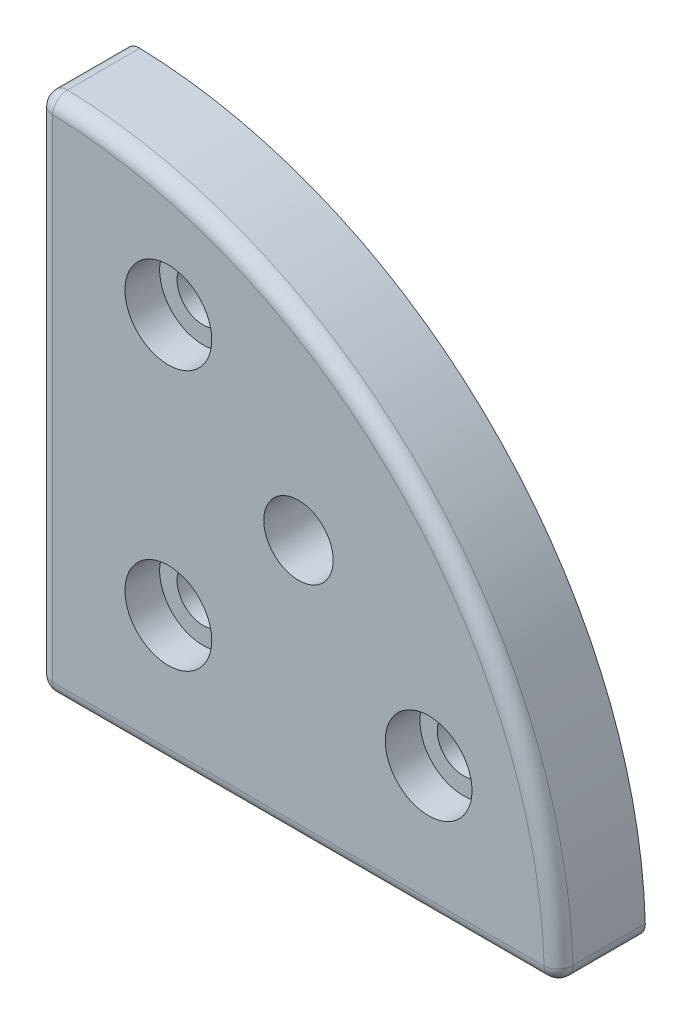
ISO-10303-21;
HEADER;
FILE_DESCRIPTION(('STEP AP214'),'2;1');
FILE_NAME('part.step','',(''),(''),'','','');
FILE_SCHEMA(('AUTOMOTIVE_DESIGN { 1 0 10303 214 1 1 1 1 }'));
ENDSEC;
DATA;
#1=APPLICATION_CONTEXT('core data for automotive mechanical design processes');
#2=APPLICATION_PROTOCOL_DEFINITION('international standard','automotive_design',2000,#1);
#3=PRODUCT_CONTEXT('',#1,'mechanical');
#4=PRODUCT('Part','Part','',(#3));
#5=PRODUCT_RELATED_PRODUCT_CATEGORY('part','',(#4));
#6=PRODUCT_DEFINITION_FORMATION('','',#4);
#7=PRODUCT_DEFINITION_CONTEXT('part definition',#1,'design');
#8=PRODUCT_DEFINITION('design','',#6,#7);
#9=PRODUCT_DEFINITION_SHAPE('','',#8);
#10=(LENGTH_UNIT() NAMED_UNIT(*) SI_UNIT(.MILLI.,.METRE.));
#11=(NAMED_UNIT(*) PLANE_ANGLE_UNIT() SI_UNIT($,.RADIAN.));
#12=(NAMED_UNIT(*) SI_UNIT($,.STERADIAN.) SOLID_ANGLE_UNIT());
#13=UNCERTAINTY_MEASURE_WITH_UNIT(LENGTH_MEASURE(1.E-05),#10,'distance_accuracy_value','');
#14=(GEOMETRIC_REPRESENTATION_CONTEXT(3) GLOBAL_UNCERTAINTY_ASSIGNED_CONTEXT((#13)) GLOBAL_UNIT_ASSIGNED_CONTEXT((#10,
#11,#12)) REPRESENTATION_CONTEXT('',''));
#15=CARTESIAN_POINT('',(0.,0.,0.));
#16=DIRECTION('',(0.,0.,1.));
#17=DIRECTION('',(1.,0.,0.));
#18=AXIS2_PLACEMENT_3D('',#15,#16,#17);
#19=CARTESIAN_POINT('',(65.9103992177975,51.8447142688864,9.));
#20=DIRECTION('',(0.,0.,1.));
#21=DIRECTION('',(1.,0.,0.));
#22=AXIS2_PLACEMENT_3D('',#19,#20,#21);
#23=CYLINDRICAL_SURFACE('',#22,7.5);
#24=CARTESIAN_POINT('',(65.9103992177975,51.8447142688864,9.));
#25=DIRECTION('',(0.,0.,1.));
#26=DIRECTION('',(1.,0.,0.));
#27=AXIS2_PLACEMENT_3D('',#24,#25,#26);
#28=CIRCLE('',#27,7.5);
#29=CARTESIAN_POINT('',(73.4103992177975,51.8447142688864,9.));
#30=VERTEX_POINT('',#29);
#31=EDGE_CURVE('E150',#30,#30,#28,.T.);
#32=ORIENTED_EDGE('',*,*,#31,.F.);
#33=EDGE_LOOP('',(#32));
#34=FACE_BOUND('',#33,.T.);
#35=CARTESIAN_POINT('',(65.9103992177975,51.8447142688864,15.));
#36=DIRECTION('',(0.,0.,1.));
#37=DIRECTION('',(1.,0.,0.));
#38=AXIS2_PLACEMENT_3D('',#35,#36,#37);
#39=CIRCLE('',#38,7.5);
#40=CARTESIAN_POINT('',(73.4103992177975,51.8447142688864,15.));
#41=VERTEX_POINT('',#40);
#42=EDGE_CURVE('E159',#41,#41,#39,.F.);
#43=ORIENTED_EDGE('',*,*,#42,.F.);
#44=EDGE_LOOP('',(#43));
#45=FACE_BOUND('',#44,.T.);
#46=ADVANCED_FACE('F15',(#34,#45),#23,.F.);
#47=CARTESIAN_POINT('',(20.9103992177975,51.8447142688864,9.));
#48=DIRECTION('',(0.,0.,1.));
#49=DIRECTION('',(1.,0.,0.));
#50=AXIS2_PLACEMENT_3D('',#47,#48,#49);
#51=CYLINDRICAL_SURFACE('',#50,7.5);
#52=CARTESIAN_POINT('',(20.9103992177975,51.8447142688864,9.));
#53=DIRECTION('',(0.,0.,1.));
#54=DIRECTION('',(1.,0.,0.));
#55=AXIS2_PLACEMENT_3D('',#52,#53,#54);
#56=CIRCLE('',#55,7.5);
#57=CARTESIAN_POINT('',(28.4103992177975,51.8447142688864,9.));
#58=VERTEX_POINT('',#57);
#59=EDGE_CURVE('E147',#58,#58,#56,.T.);
#60=ORIENTED_EDGE('',*,*,#59,.F.);
#61=EDGE_LOOP('',(#60));
#62=FACE_BOUND('',#61,.T.);
#63=CARTESIAN_POINT('',(20.9103992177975,51.8447142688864,15.));
#64=DIRECTION('',(0.,0.,1.));
#65=DIRECTION('',(1.,0.,0.));
#66=AXIS2_PLACEMENT_3D('',#63,#64,#65);
#67=CIRCLE('',#66,7.5);
#68=CARTESIAN_POINT('',(28.4103992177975,51.8447142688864,15.));
#69=VERTEX_POINT('',#68);
#70=EDGE_CURVE('E156',#69,#69,#67,.F.);
#71=ORIENTED_EDGE('',*,*,#70,.F.);
#72=EDGE_LOOP('',(#71));
#73=FACE_BOUND('',#72,.T.);
#74=ADVANCED_FACE('F432',(#62,#73),#51,.F.);
#75=CARTESIAN_POINT('',(20.9103992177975,96.8447142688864,9.));
#76=DIRECTION('',(0.,0.,1.));
#77=DIRECTION('',(1.,0.,0.));
#78=AXIS2_PLACEMENT_3D('',#75,#76,#77);
#79=CYLINDRICAL_SURFACE('',#78,7.5);
#80=CARTESIAN_POINT('',(20.9103992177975,96.8447142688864,9.));
#81=DIRECTION('',(0.,0.,1.));
#82=DIRECTION('',(1.,0.,0.));
#83=AXIS2_PLACEMENT_3D('',#80,#81,#82);
#84=CIRCLE('',#83,7.5);
#85=CARTESIAN_POINT('',(28.4103992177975,96.8447142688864,9.));
#86=VERTEX_POINT('',#85);
#87=EDGE_CURVE('E143',#86,#86,#84,.T.);
#88=ORIENTED_EDGE('',*,*,#87,.F.);
#89=EDGE_LOOP('',(#88));
#90=FACE_BOUND('',#89,.T.);
#91=CARTESIAN_POINT('',(20.9103992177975,96.8447142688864,15.));
#92=DIRECTION('',(0.,0.,1.));
#93=DIRECTION('',(1.,0.,0.));
#94=AXIS2_PLACEMENT_3D('',#91,#92,#93);
#95=CIRCLE('',#94,7.5);
#96=CARTESIAN_POINT('',(28.4103992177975,96.8447142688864,15.));
#97=VERTEX_POINT('',#96);
#98=EDGE_CURVE('E153',#97,#97,#95,.F.);
#99=ORIENTED_EDGE('',*,*,#98,.F.);
#100=EDGE_LOOP('',(#99));
#101=FACE_BOUND('',#100,.T.);
#102=ADVANCED_FACE('F426',(#90,#101),#79,.F.);
#103=CARTESIAN_POINT('',(0.910399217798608,49.292880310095,12.5));
#104=DIRECTION('',(0.,1.,0.));
#105=DIRECTION('',(-1.,0.,0.));
#106=AXIS2_PLACEMENT_3D('',#103,#104,#105);
#107=CYLINDRICAL_SURFACE('',#106,2.5);
#108=CARTESIAN_POINT('',(0.910399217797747,116.808992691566,12.5));
#109=DIRECTION('',(0.,1.,0.));
#110=DIRECTION('',(-1.,0.,0.));
#111=AXIS2_PLACEMENT_3D('',#108,#109,#110);
#112=CIRCLE('',#111,2.5);
#113=CARTESIAN_POINT('',(-1.58960078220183,116.808992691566,12.5));
#114=VERTEX_POINT('',#113);
#115=CARTESIAN_POINT('',(0.910399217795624,116.808992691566,15.));
#116=VERTEX_POINT('',#115);
#117=EDGE_CURVE('E71',#114,#116,#112,.T.);
#118=ORIENTED_EDGE('',*,*,#117,.F.);
#119=DIRECTION('',(0.,1.,0.));
#120=VECTOR('',#119,1.);
#121=CARTESIAN_POINT('',(-1.58960078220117,31.8447142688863,12.5));
#122=LINE('',#121,#120);
#123=CARTESIAN_POINT('',(-1.58960078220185,31.8447142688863,12.5));
#124=VERTEX_POINT('',#123);
#125=EDGE_CURVE('E146',#124,#114,#122,.T.);
#126=ORIENTED_EDGE('',*,*,#125,.F.);
#127=CARTESIAN_POINT('',(0.910399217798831,31.8447142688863,12.5));
#128=DIRECTION('',(0.,1.,0.));
#129=DIRECTION('',(-1.,0.,0.));
#130=AXIS2_PLACEMENT_3D('',#127,#128,#129);
#131=CIRCLE('',#130,2.5);
#132=CARTESIAN_POINT('',(0.910399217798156,31.8447142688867,15.));
#133=VERTEX_POINT('',#132);
#134=EDGE_CURVE('E18',#133,#124,#131,.F.);
#135=ORIENTED_EDGE('',*,*,#134,.F.);
#136=DIRECTION('',(0.,1.,0.));
#137=VECTOR('',#136,1.);
#138=CARTESIAN_POINT('',(0.910399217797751,66.741046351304,15.));
#139=LINE('',#138,#137);
#140=EDGE_CURVE('E162',#116,#133,#139,.F.);
#141=ORIENTED_EDGE('',*,*,#140,.F.);
#142=EDGE_LOOP('',(#118,#126,#135,#141));
#143=FACE_BOUND('',#142,.T.);
#144=ADVANCED_FACE('F186',(#143),#107,.T.);
#145=CARTESIAN_POINT('',(0.910399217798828,31.8447142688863,12.5));
#146=DIRECTION('',(-0.707106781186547,0.707106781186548,0.));
#147=DIRECTION('',(-0.707106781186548,-0.707106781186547,0.));
#148=AXIS2_PLACEMENT_3D('',#145,#146,#147);
#149=SPHERICAL_SURFACE('',#148,2.5);
#150=CARTESIAN_POINT('',(0.910399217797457,31.8447142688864,12.5));
#151=DIRECTION('',(0.,0.,1.));
#152=DIRECTION('',(1.,0.,0.));
#153=AXIS2_PLACEMENT_3D('',#150,#151,#152);
#154=CIRCLE('',#153,2.5);
#155=CARTESIAN_POINT('',(0.910399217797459,29.3447142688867,12.5));
#156=VERTEX_POINT('',#155);
#157=EDGE_CURVE('E183',#156,#124,#154,.F.);
#158=ORIENTED_EDGE('',*,*,#157,.F.);
#159=CARTESIAN_POINT('',(0.910399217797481,31.8447142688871,12.5));
#160=DIRECTION('',(-1.,0.,0.));
#161=DIRECTION('',(0.,-1.,0.));
#162=AXIS2_PLACEMENT_3D('',#159,#160,#161);
#163=CIRCLE('',#162,2.5);
#164=EDGE_CURVE('E177',#133,#156,#163,.F.);
#165=ORIENTED_EDGE('',*,*,#164,.F.);
#166=ORIENTED_EDGE('',*,*,#134,.T.);
#167=EDGE_LOOP('',(#158,#165,#166));
#168=FACE_BOUND('',#167,.T.);
#169=ADVANCED_FACE('F182',(#168),#149,.T.);
#170=CARTESIAN_POINT('',(60.8407044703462,31.8447142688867,12.5));
#171=DIRECTION('',(-1.,0.,0.));
#172=DIRECTION('',(0.,-1.,0.));
#173=AXIS2_PLACEMENT_3D('',#170,#171,#172);
#174=CYLINDRICAL_SURFACE('',#173,2.5);
#175=ORIENTED_EDGE('',*,*,#164,.T.);
#176=DIRECTION('',(1.,0.,0.));
#177=VECTOR('',#176,1.);
#178=CARTESIAN_POINT('',(85.8746776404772,29.3447142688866,12.5));
#179=LINE('',#178,#177);
#180=CARTESIAN_POINT('',(85.8746776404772,29.3447142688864,12.5));
#181=VERTEX_POINT('',#180);
#182=EDGE_CURVE('E97',#181,#156,#179,.F.);
#183=ORIENTED_EDGE('',*,*,#182,.F.);
#184=CARTESIAN_POINT('',(85.8746776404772,31.8447142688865,12.5));
#185=DIRECTION('',(-1.,0.,0.));
#186=DIRECTION('',(0.,-1.,0.));
#187=AXIS2_PLACEMENT_3D('',#184,#185,#186);
#188=CIRCLE('',#187,2.5);
#189=CARTESIAN_POINT('',(85.8746776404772,31.8447142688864,15.));
#190=VERTEX_POINT('',#189);
#191=EDGE_CURVE('E173',#190,#181,#188,.F.);
#192=ORIENTED_EDGE('',*,*,#191,.F.);
#193=DIRECTION('',(1.,0.,0.));
#194=VECTOR('',#193,1.);
#195=CARTESIAN_POINT('',(35.8067313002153,31.8447142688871,15.));
#196=LINE('',#195,#194);
#197=EDGE_CURVE('E164',#133,#190,#196,.T.);
#198=ORIENTED_EDGE('',*,*,#197,.F.);
#199=EDGE_LOOP('',(#175,#183,#192,#198));
#200=FACE_BOUND('',#199,.T.);
#201=ADVANCED_FACE('F240',(#200),#174,.T.);
#202=CARTESIAN_POINT('',(85.8746776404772,31.8447142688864,12.5));
#203=DIRECTION('',(-0.707106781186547,0.707106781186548,0.));
#204=DIRECTION('',(-0.707106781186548,-0.707106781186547,0.));
#205=AXIS2_PLACEMENT_3D('',#202,#203,#204);
#206=SPHERICAL_SURFACE('',#205,2.5);
#207=CARTESIAN_POINT('',(85.8746776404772,31.8447142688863,12.5));
#208=DIRECTION('',(0.,0.,1.));
#209=DIRECTION('',(1.,0.,0.));
#210=AXIS2_PLACEMENT_3D('',#207,#208,#209);
#211=CIRCLE('',#210,2.5);
#212=CARTESIAN_POINT('',(88.3736570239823,31.916142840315,12.5));
#213=VERTEX_POINT('',#212);
#214=CARTESIAN_POINT('',(87.6424445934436,30.07694731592,12.5));
#215=VERTEX_POINT('',#214);
#216=EDGE_CURVE('E33',#213,#215,#211,.F.);
#217=ORIENTED_EDGE('',*,*,#216,.F.);
#218=CARTESIAN_POINT('',(85.8746776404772,31.8447142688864,12.5));
#219=DIRECTION('',(0.0285714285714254,-0.999591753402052,0.));
#220=DIRECTION('',(0.999591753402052,0.0285714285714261,0.));
#221=AXIS2_PLACEMENT_3D('',#218,#219,#220);
#222=CIRCLE('',#221,2.5);
#223=EDGE_CURVE('E169',#190,#213,#222,.F.);
#224=ORIENTED_EDGE('',*,*,#223,.F.);
#225=ORIENTED_EDGE('',*,*,#191,.T.);
#226=CARTESIAN_POINT('',(85.8746776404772,31.8447142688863,12.5));
#227=DIRECTION('',(0.,0.,1.));
#228=DIRECTION('',(1.,0.,0.));
#229=AXIS2_PLACEMENT_3D('',#226,#227,#228);
#230=CIRCLE('',#229,2.5);
#231=EDGE_CURVE('E140',#215,#181,#230,.F.);
#232=ORIENTED_EDGE('',*,*,#231,.F.);
#233=EDGE_LOOP('',(#217,#224,#225,#232));
#234=FACE_BOUND('',#233,.T.);
#235=ADVANCED_FACE('F237',(#234),#206,.T.);
#236=CARTESIAN_POINT('',(-1.58960078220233,29.3447142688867,12.5));
#237=DIRECTION('',(0.,0.,-1.));
#238=DIRECTION('',(0.707106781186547,-0.707106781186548,0.));
#239=AXIS2_PLACEMENT_3D('',#236,#237,#238);
#240=TOROIDAL_SURFACE('',#239,87.5,2.5);
#241=ORIENTED_EDGE('',*,*,#223,.T.);
#242=CARTESIAN_POINT('',(-1.58960078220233,29.3447142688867,12.5));
#243=DIRECTION('',(0.,0.,1.));
#244=DIRECTION('',(1.,0.,0.));
#245=AXIS2_PLACEMENT_3D('',#242,#243,#244);
#246=CIRCLE('',#245,90.);
#247=CARTESIAN_POINT('',(0.981827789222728,119.307972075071,12.5));
#248=VERTEX_POINT('',#247);
#249=EDGE_CURVE('E231',#248,#213,#246,.F.);
#250=ORIENTED_EDGE('',*,*,#249,.F.);
#251=CARTESIAN_POINT('',(0.910399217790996,116.808992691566,12.5));
#252=DIRECTION('',(0.999591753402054,-0.0285714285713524,0.));
#253=DIRECTION('',(0.0285714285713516,0.999591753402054,0.));
#254=AXIS2_PLACEMENT_3D('',#251,#252,#253);
#255=CIRCLE('',#254,2.5);
#256=EDGE_CURVE('E165',#116,#248,#255,.F.);
#257=ORIENTED_EDGE('',*,*,#256,.F.);
#258=CARTESIAN_POINT('',(-1.58960078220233,29.3447142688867,15.));
#259=DIRECTION('',(0.,0.,-1.));
#260=DIRECTION('',(0.0285714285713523,0.999591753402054,0.));
#261=AXIS2_PLACEMENT_3D('',#258,#259,#260);
#262=CIRCLE('',#261,87.4999999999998);
#263=EDGE_CURVE('E200',#190,#116,#262,.F.);
#264=ORIENTED_EDGE('',*,*,#263,.F.);
#265=EDGE_LOOP('',(#241,#250,#257,#264));
#266=FACE_BOUND('',#265,.T.);
#267=ADVANCED_FACE('F224',(#266),#240,.T.);
#268=CARTESIAN_POINT('',(0.910399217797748,116.808992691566,12.5));
#269=DIRECTION('',(-0.707106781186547,0.707106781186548,0.));
#270=DIRECTION('',(-0.707106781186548,-0.707106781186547,0.));
#271=AXIS2_PLACEMENT_3D('',#268,#269,#270);
#272=SPHERICAL_SURFACE('',#271,2.5);
#273=CARTESIAN_POINT('',(0.910399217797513,116.808992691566,12.5));
#274=DIRECTION('',(0.,0.,1.));
#275=DIRECTION('',(1.,0.,0.));
#276=AXIS2_PLACEMENT_3D('',#273,#274,#275);
#277=CIRCLE('',#276,2.5);
#278=CARTESIAN_POINT('',(-0.857367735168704,118.576759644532,12.5));
#279=VERTEX_POINT('',#278);
#280=EDGE_CURVE('E139',#114,#279,#277,.F.);
#281=ORIENTED_EDGE('',*,*,#280,.F.);
#282=ORIENTED_EDGE('',*,*,#117,.T.);
#283=ORIENTED_EDGE('',*,*,#256,.T.);
#284=CARTESIAN_POINT('',(0.910399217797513,116.808992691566,12.5));
#285=DIRECTION('',(0.,0.,1.));
#286=DIRECTION('',(1.,0.,0.));
#287=AXIS2_PLACEMENT_3D('',#284,#285,#286);
#288=CIRCLE('',#287,2.5);
#289=EDGE_CURVE('E135',#279,#248,#288,.F.);
#290=ORIENTED_EDGE('',*,*,#289,.F.);
#291=EDGE_LOOP('',(#281,#282,#283,#290));
#292=FACE_BOUND('',#291,.T.);
#293=ADVANCED_FACE('F218',(#292),#272,.T.);
#294=CARTESIAN_POINT('',(35.8067313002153,66.741046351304,15.));
#295=DIRECTION('',(0.,0.,1.));
#296=DIRECTION('',(1.,0.,0.));
#297=AXIS2_PLACEMENT_3D('',#294,#295,#296);
#298=PLANE('',#297);
#299=ORIENTED_EDGE('',*,*,#98,.T.);
#300=EDGE_LOOP('',(#299));
#301=FACE_BOUND('',#300,.T.);
#302=ORIENTED_EDGE('',*,*,#70,.T.);
#303=EDGE_LOOP('',(#302));
#304=FACE_BOUND('',#303,.T.);
#305=ORIENTED_EDGE('',*,*,#42,.T.);
#306=EDGE_LOOP('',(#305));
#307=FACE_BOUND('',#306,.T.);
#308=CARTESIAN_POINT('',(43.4103992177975,74.3447142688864,15.));
#309=DIRECTION('',(0.,0.,1.));
#310=DIRECTION('',(1.,0.,0.));
#311=AXIS2_PLACEMENT_3D('',#308,#309,#310);
#312=CIRCLE('',#311,6.);
#313=CARTESIAN_POINT('',(49.4103992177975,74.3447142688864,15.));
#314=VERTEX_POINT('',#313);
#315=EDGE_CURVE('E131',#314,#314,#312,.F.);
#316=ORIENTED_EDGE('',*,*,#315,.T.);
#317=EDGE_LOOP('',(#316));
#318=FACE_BOUND('',#317,.T.);
#319=ORIENTED_EDGE('',*,*,#263,.T.);
#320=ORIENTED_EDGE('',*,*,#140,.T.);
#321=ORIENTED_EDGE('',*,*,#197,.T.);
#322=EDGE_LOOP('',(#319,#320,#321));
#323=FACE_BOUND('',#322,.T.);
#324=ADVANCED_FACE('F207',(#301,#304,#307,#318,#323),#298,.T.);
#325=CARTESIAN_POINT('',(65.9103992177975,51.8447142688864,9.));
#326=DIRECTION('',(0.,0.,1.));
#327=DIRECTION('',(1.,0.,0.));
#328=AXIS2_PLACEMENT_3D('',#325,#326,#327);
#329=PLANE('',#328);
#330=CARTESIAN_POINT('',(65.9103992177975,51.8447142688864,9.));
#331=DIRECTION('',(0.,0.,1.));
#332=DIRECTION('',(1.,0.,0.));
#333=AXIS2_PLACEMENT_3D('',#330,#331,#332);
#334=CIRCLE('',#333,4.5);
#335=CARTESIAN_POINT('',(70.4103992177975,51.8447142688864,9.));
#336=VERTEX_POINT('',#335);
#337=EDGE_CURVE('E128',#336,#336,#334,.F.);
#338=ORIENTED_EDGE('',*,*,#337,.T.);
#339=EDGE_LOOP('',(#338));
#340=FACE_BOUND('',#339,.T.);
#341=ORIENTED_EDGE('',*,*,#31,.T.);
#342=EDGE_LOOP('',(#341));
#343=FACE_BOUND('',#342,.T.);
#344=ADVANCED_FACE('F217',(#340,#343),#329,.T.);
#345=CARTESIAN_POINT('',(20.9103992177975,51.8447142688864,9.));
#346=DIRECTION('',(0.,0.,1.));
#347=DIRECTION('',(1.,0.,0.));
#348=AXIS2_PLACEMENT_3D('',#345,#346,#347);
#349=PLANE('',#348);
#350=CARTESIAN_POINT('',(20.9103992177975,51.8447142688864,9.));
#351=DIRECTION('',(0.,0.,1.));
#352=DIRECTION('',(1.,0.,0.));
#353=AXIS2_PLACEMENT_3D('',#350,#351,#352);
#354=CIRCLE('',#353,4.5);
#355=CARTESIAN_POINT('',(25.4103992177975,51.8447142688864,9.));
#356=VERTEX_POINT('',#355);
#357=EDGE_CURVE('E125',#356,#356,#354,.F.);
#358=ORIENTED_EDGE('',*,*,#357,.T.);
#359=EDGE_LOOP('',(#358));
#360=FACE_BOUND('',#359,.T.);
#361=ORIENTED_EDGE('',*,*,#59,.T.);
#362=EDGE_LOOP('',(#361));
#363=FACE_BOUND('',#362,.T.);
#364=ADVANCED_FACE('F381',(#360,#363),#349,.T.);
#365=CARTESIAN_POINT('',(20.9103992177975,96.8447142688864,9.));
#366=DIRECTION('',(0.,0.,1.));
#367=DIRECTION('',(1.,0.,0.));
#368=AXIS2_PLACEMENT_3D('',#365,#366,#367);
#369=PLANE('',#368);
#370=CARTESIAN_POINT('',(20.9103992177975,96.8447142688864,9.));
#371=DIRECTION('',(0.,0.,1.));
#372=DIRECTION('',(1.,0.,0.));
#373=AXIS2_PLACEMENT_3D('',#370,#371,#372);
#374=CIRCLE('',#373,4.5);
#375=CARTESIAN_POINT('',(25.4103992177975,96.8447142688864,9.));
#376=VERTEX_POINT('',#375);
#377=EDGE_CURVE('E118',#376,#376,#374,.F.);
#378=ORIENTED_EDGE('',*,*,#377,.T.);
#379=EDGE_LOOP('',(#378));
#380=FACE_BOUND('',#379,.T.);
#381=ORIENTED_EDGE('',*,*,#87,.T.);
#382=EDGE_LOOP('',(#381));
#383=FACE_BOUND('',#382,.T.);
#384=ADVANCED_FACE('F374',(#380,#383),#369,.T.);
#385=CARTESIAN_POINT('',(-1.58960078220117,31.8447142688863,0.));
#386=DIRECTION('',(-1.,0.,0.));
#387=DIRECTION('',(0.,0.,1.));
#388=AXIS2_PLACEMENT_3D('',#385,#386,#387);
#389=PLANE('',#388);
#390=DIRECTION('',(0.,1.,0.));
#391=VECTOR('',#390,1.);
#392=CARTESIAN_POINT('',(-1.58960078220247,66.741046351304,0.));
#393=LINE('',#392,#391);
#394=CARTESIAN_POINT('',(-1.58960078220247,116.808992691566,0.));
#395=VERTEX_POINT('',#394);
#396=CARTESIAN_POINT('',(-1.5896007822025,31.8447142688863,0.));
#397=VERTEX_POINT('',#396);
#398=EDGE_CURVE('E116',#395,#397,#393,.F.);
#399=ORIENTED_EDGE('',*,*,#398,.T.);
#400=DIRECTION('',(0.,0.,1.));
#401=VECTOR('',#400,1.);
#402=CARTESIAN_POINT('',(-1.58960078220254,31.8447142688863,0.));
#403=LINE('',#402,#401);
#404=EDGE_CURVE('E115',#124,#397,#403,.F.);
#405=ORIENTED_EDGE('',*,*,#404,.F.);
#406=ORIENTED_EDGE('',*,*,#125,.T.);
#407=DIRECTION('',(0.,0.,1.));
#408=VECTOR('',#407,1.);
#409=CARTESIAN_POINT('',(-1.58960078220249,116.808992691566,0.));
#410=LINE('',#409,#408);
#411=EDGE_CURVE('E134',#395,#114,#410,.T.);
#412=ORIENTED_EDGE('',*,*,#411,.F.);
#413=EDGE_LOOP('',(#399,#405,#406,#412));
#414=FACE_BOUND('',#413,.T.);
#415=ADVANCED_FACE('F190',(#414),#389,.T.);
#416=CARTESIAN_POINT('',(0.910399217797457,31.8447142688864,0.));
#417=DIRECTION('',(0.,0.,1.));
#418=DIRECTION('',(1.,0.,0.));
#419=AXIS2_PLACEMENT_3D('',#416,#417,#418);
#420=CYLINDRICAL_SURFACE('',#419,2.5);
#421=CARTESIAN_POINT('',(0.910399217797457,31.8447142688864,0.));
#422=DIRECTION('',(0.,0.,1.));
#423=DIRECTION('',(1.,0.,0.));
#424=AXIS2_PLACEMENT_3D('',#421,#422,#423);
#425=CIRCLE('',#424,2.5);
#426=CARTESIAN_POINT('',(0.910399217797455,29.3447142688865,0.));
#427=VERTEX_POINT('',#426);
#428=EDGE_CURVE('E108',#397,#427,#425,.T.);
#429=ORIENTED_EDGE('',*,*,#428,.T.);
#430=DIRECTION('',(0.,0.,-1.));
#431=VECTOR('',#430,1.);
#432=CARTESIAN_POINT('',(0.910399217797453,29.3447142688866,0.));
#433=LINE('',#432,#431);
#434=EDGE_CURVE('E91',#156,#427,#433,.T.);
#435=ORIENTED_EDGE('',*,*,#434,.F.);
#436=ORIENTED_EDGE('',*,*,#157,.T.);
#437=ORIENTED_EDGE('',*,*,#404,.T.);
#438=EDGE_LOOP('',(#429,#435,#436,#437));
#439=FACE_BOUND('',#438,.T.);
#440=ADVANCED_FACE('F113',(#439),#420,.T.);
#441=CARTESIAN_POINT('',(85.8746776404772,29.3447142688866,0.));
#442=DIRECTION('',(0.,-1.,0.));
#443=DIRECTION('',(0.,0.,-1.));
#444=AXIS2_PLACEMENT_3D('',#441,#442,#443);
#445=PLANE('',#444);
#446=DIRECTION('',(1.,0.,0.));
#447=VECTOR('',#446,1.);
#448=CARTESIAN_POINT('',(35.8067313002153,29.3447142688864,0.));
#449=LINE('',#448,#447);
#450=CARTESIAN_POINT('',(85.8746776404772,29.3447142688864,0.));
#451=VERTEX_POINT('',#450);
#452=EDGE_CURVE('E95',#427,#451,#449,.T.);
#453=ORIENTED_EDGE('',*,*,#452,.T.);
#454=DIRECTION('',(0.,0.,1.));
#455=VECTOR('',#454,1.);
#456=CARTESIAN_POINT('',(85.8746776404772,29.3447142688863,0.));
#457=LINE('',#456,#455);
#458=EDGE_CURVE('E142',#181,#451,#457,.F.);
#459=ORIENTED_EDGE('',*,*,#458,.F.);
#460=ORIENTED_EDGE('',*,*,#182,.T.);
#461=ORIENTED_EDGE('',*,*,#434,.T.);
#462=EDGE_LOOP('',(#453,#459,#460,#461));
#463=FACE_BOUND('',#462,.T.);
#464=ADVANCED_FACE('F93',(#463),#445,.T.);
#465=CARTESIAN_POINT('',(85.8746776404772,31.8447142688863,0.));
#466=DIRECTION('',(0.,0.,1.));
#467=DIRECTION('',(1.,0.,0.));
#468=AXIS2_PLACEMENT_3D('',#465,#466,#467);
#469=CYLINDRICAL_SURFACE('',#468,2.5);
#470=CARTESIAN_POINT('',(85.8746776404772,31.8447142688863,0.));
#471=DIRECTION('',(0.,0.,1.));
#472=DIRECTION('',(1.,0.,0.));
#473=AXIS2_PLACEMENT_3D('',#470,#471,#472);
#474=CIRCLE('',#473,2.5);
#475=CARTESIAN_POINT('',(88.3736570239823,31.916142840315,0.));
#476=VERTEX_POINT('',#475);
#477=EDGE_CURVE('E111',#451,#476,#474,.T.);
#478=ORIENTED_EDGE('',*,*,#477,.T.);
#479=DIRECTION('',(0.,0.,1.));
#480=VECTOR('',#479,1.);
#481=CARTESIAN_POINT('',(88.3736570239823,31.916142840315,0.));
#482=LINE('',#481,#480);
#483=EDGE_CURVE('E274',#213,#476,#482,.F.);
#484=ORIENTED_EDGE('',*,*,#483,.F.);
#485=ORIENTED_EDGE('',*,*,#216,.T.);
#486=ORIENTED_EDGE('',*,*,#231,.T.);
#487=ORIENTED_EDGE('',*,*,#458,.T.);
#488=EDGE_LOOP('',(#478,#484,#485,#486,#487));
#489=FACE_BOUND('',#488,.T.);
#490=ADVANCED_FACE('F273',(#489),#469,.T.);
#491=CARTESIAN_POINT('',(-1.58960078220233,29.3447142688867,0.));
#492=DIRECTION('',(0.,0.,1.));
#493=DIRECTION('',(1.,0.,0.));
#494=AXIS2_PLACEMENT_3D('',#491,#492,#493);
#495=CYLINDRICAL_SURFACE('',#494,90.);
#496=CARTESIAN_POINT('',(-1.58960078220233,29.3447142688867,0.));
#497=DIRECTION('',(0.,0.,1.));
#498=DIRECTION('',(1.,0.,0.));
#499=AXIS2_PLACEMENT_3D('',#496,#497,#498);
#500=CIRCLE('',#499,90.);
#501=CARTESIAN_POINT('',(0.981827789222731,119.307972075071,0.));
#502=VERTEX_POINT('',#501);
#503=EDGE_CURVE('E269',#476,#502,#500,.T.);
#504=ORIENTED_EDGE('',*,*,#503,.T.);
#505=DIRECTION('',(0.,0.,1.));
#506=VECTOR('',#505,1.);
#507=CARTESIAN_POINT('',(0.981827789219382,119.307972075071,0.));
#508=LINE('',#507,#506);
#509=EDGE_CURVE('E138',#248,#502,#508,.F.);
#510=ORIENTED_EDGE('',*,*,#509,.F.);
#511=ORIENTED_EDGE('',*,*,#249,.T.);
#512=ORIENTED_EDGE('',*,*,#483,.T.);
#513=EDGE_LOOP('',(#504,#510,#511,#512));
#514=FACE_BOUND('',#513,.T.);
#515=ADVANCED_FACE('F286',(#514),#495,.T.);
#516=CARTESIAN_POINT('',(0.910399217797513,116.808992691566,0.));
#517=DIRECTION('',(0.,0.,1.));
#518=DIRECTION('',(1.,0.,0.));
#519=AXIS2_PLACEMENT_3D('',#516,#517,#518);
#520=CYLINDRICAL_SURFACE('',#519,2.5);
#521=CARTESIAN_POINT('',(0.910399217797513,116.808992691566,0.));
#522=DIRECTION('',(0.,0.,1.));
#523=DIRECTION('',(1.,0.,0.));
#524=AXIS2_PLACEMENT_3D('',#521,#522,#523);
#525=CIRCLE('',#524,2.5);
#526=EDGE_CURVE('E267',#502,#395,#525,.T.);
#527=ORIENTED_EDGE('',*,*,#526,.T.);
#528=ORIENTED_EDGE('',*,*,#411,.T.);
#529=ORIENTED_EDGE('',*,*,#280,.T.);
#530=ORIENTED_EDGE('',*,*,#289,.T.);
#531=ORIENTED_EDGE('',*,*,#509,.T.);
#532=EDGE_LOOP('',(#527,#528,#529,#530,#531));
#533=FACE_BOUND('',#532,.T.);
#534=ADVANCED_FACE('F282',(#533),#520,.T.);
#535=CARTESIAN_POINT('',(43.4103992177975,74.3447142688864,0.));
#536=DIRECTION('',(0.,0.,1.));
#537=DIRECTION('',(1.,0.,0.));
#538=AXIS2_PLACEMENT_3D('',#535,#536,#537);
#539=CYLINDRICAL_SURFACE('',#538,6.);
#540=CARTESIAN_POINT('',(43.4103992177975,74.3447142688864,0.));
#541=DIRECTION('',(0.,0.,1.));
#542=DIRECTION('',(1.,0.,0.));
#543=AXIS2_PLACEMENT_3D('',#540,#541,#542);
#544=CIRCLE('',#543,6.);
#545=CARTESIAN_POINT('',(49.4103992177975,74.3447142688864,0.));
#546=VERTEX_POINT('',#545);
#547=EDGE_CURVE('E264',#546,#546,#544,.F.);
#548=ORIENTED_EDGE('',*,*,#547,.T.);
#549=EDGE_LOOP('',(#548));
#550=FACE_BOUND('',#549,.T.);
#551=ORIENTED_EDGE('',*,*,#315,.F.);
#552=EDGE_LOOP('',(#551));
#553=FACE_BOUND('',#552,.T.);
#554=ADVANCED_FACE('F294',(#550,#553),#539,.F.);
#555=CARTESIAN_POINT('',(65.9103992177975,51.8447142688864,0.));
#556=DIRECTION('',(0.,0.,1.));
#557=DIRECTION('',(1.,0.,0.));
#558=AXIS2_PLACEMENT_3D('',#555,#556,#557);
#559=CYLINDRICAL_SURFACE('',#558,4.5);
#560=CARTESIAN_POINT('',(65.9103992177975,51.8447142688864,0.));
#561=DIRECTION('',(0.,0.,1.));
#562=DIRECTION('',(1.,0.,0.));
#563=AXIS2_PLACEMENT_3D('',#560,#561,#562);
#564=CIRCLE('',#563,4.5);
#565=CARTESIAN_POINT('',(70.4103992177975,51.8447142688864,0.));
#566=VERTEX_POINT('',#565);
#567=EDGE_CURVE('E261',#566,#566,#564,.F.);
#568=ORIENTED_EDGE('',*,*,#567,.T.);
#569=EDGE_LOOP('',(#568));
#570=FACE_BOUND('',#569,.T.);
#571=ORIENTED_EDGE('',*,*,#337,.F.);
#572=EDGE_LOOP('',(#571));
#573=FACE_BOUND('',#572,.T.);
#574=ADVANCED_FACE('F312',(#570,#573),#559,.F.);
#575=CARTESIAN_POINT('',(20.9103992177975,51.8447142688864,0.));
#576=DIRECTION('',(0.,0.,1.));
#577=DIRECTION('',(1.,0.,0.));
#578=AXIS2_PLACEMENT_3D('',#575,#576,#577);
#579=CYLINDRICAL_SURFACE('',#578,4.5);
#580=CARTESIAN_POINT('',(20.9103992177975,51.8447142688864,0.));
#581=DIRECTION('',(0.,0.,1.));
#582=DIRECTION('',(1.,0.,0.));
#583=AXIS2_PLACEMENT_3D('',#580,#581,#582);
#584=CIRCLE('',#583,4.5);
#585=CARTESIAN_POINT('',(25.4103992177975,51.8447142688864,0.));
#586=VERTEX_POINT('',#585);
#587=EDGE_CURVE('E24',#586,#586,#584,.F.);
#588=ORIENTED_EDGE('',*,*,#587,.T.);
#589=EDGE_LOOP('',(#588));
#590=FACE_BOUND('',#589,.T.);
#591=ORIENTED_EDGE('',*,*,#357,.F.);
#592=EDGE_LOOP('',(#591));
#593=FACE_BOUND('',#592,.T.);
#594=ADVANCED_FACE('F304',(#590,#593),#579,.F.);
#595=CARTESIAN_POINT('',(20.9103992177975,96.8447142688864,0.));
#596=DIRECTION('',(0.,0.,1.));
#597=DIRECTION('',(1.,0.,0.));
#598=AXIS2_PLACEMENT_3D('',#595,#596,#597);
#599=CYLINDRICAL_SURFACE('',#598,4.5);
#600=CARTESIAN_POINT('',(20.9103992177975,96.8447142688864,0.));
#601=DIRECTION('',(0.,0.,1.));
#602=DIRECTION('',(1.,0.,0.));
#603=AXIS2_PLACEMENT_3D('',#600,#601,#602);
#604=CIRCLE('',#603,4.5);
#605=CARTESIAN_POINT('',(25.4103992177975,96.8447142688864,0.));
#606=VERTEX_POINT('',#605);
#607=EDGE_CURVE('E10',#606,#606,#604,.F.);
#608=ORIENTED_EDGE('',*,*,#607,.T.);
#609=EDGE_LOOP('',(#608));
#610=FACE_BOUND('',#609,.T.);
#611=ORIENTED_EDGE('',*,*,#377,.F.);
#612=EDGE_LOOP('',(#611));
#613=FACE_BOUND('',#612,.T.);
#614=ADVANCED_FACE('F298',(#610,#613),#599,.F.);
#615=CARTESIAN_POINT('',(35.8067313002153,66.741046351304,0.));
#616=DIRECTION('',(0.,0.,1.));
#617=DIRECTION('',(1.,0.,0.));
#618=AXIS2_PLACEMENT_3D('',#615,#616,#617);
#619=PLANE('',#618);
#620=ORIENTED_EDGE('',*,*,#607,.F.);
#621=EDGE_LOOP('',(#620));
#622=FACE_BOUND('',#621,.T.);
#623=ORIENTED_EDGE('',*,*,#587,.F.);
#624=EDGE_LOOP('',(#623));
#625=FACE_BOUND('',#624,.T.);
#626=ORIENTED_EDGE('',*,*,#567,.F.);
#627=EDGE_LOOP('',(#626));
#628=FACE_BOUND('',#627,.T.);
#629=ORIENTED_EDGE('',*,*,#547,.F.);
#630=EDGE_LOOP('',(#629));
#631=FACE_BOUND('',#630,.T.);
#632=ORIENTED_EDGE('',*,*,#503,.F.);
#633=ORIENTED_EDGE('',*,*,#477,.F.);
#634=ORIENTED_EDGE('',*,*,#452,.F.);
#635=ORIENTED_EDGE('',*,*,#428,.F.);
#636=ORIENTED_EDGE('',*,*,#398,.F.);
#637=ORIENTED_EDGE('',*,*,#526,.F.);
#638=EDGE_LOOP('',(#632,#633,#634,#635,#636,#637));
#639=FACE_BOUND('',#638,.T.);
#640=ADVANCED_FACE('F107',(#622,#625,#628,#631,#639),#619,.F.);
#641=CLOSED_SHELL('',(#46,#74,#102,#144,#169,#201,#235,#267,#293,#324,#344,#364,#384,#415,#440,
#464,#490,#515,#534,#554,#574,#594,#614,#640));
#642=MANIFOLD_SOLID_BREP('B1',#641);
#643=ADVANCED_BREP_SHAPE_REPRESENTATION('',(#18,#642),#14);
#644=SHAPE_DEFINITION_REPRESENTATION(#9,#643);
ENDSEC;
END-ISO-10303-21;
